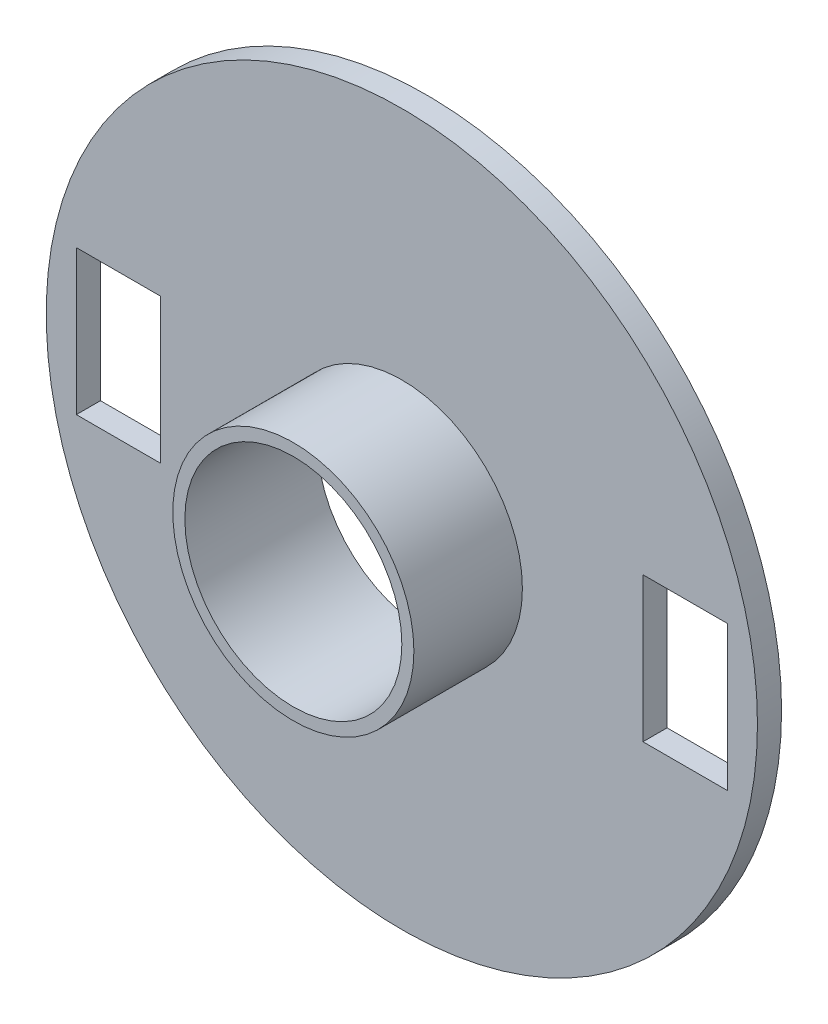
from build123d import *

# Parameters (mm, degrees)
SKETCH1_R           = 14.75
BOSS_EXTRUDE1_DEPTH = 1
SKETCH2_R           = 5
BOSS_EXTRUDE2_DEPTH = 4.5
SKETCH3_R           = 4.5
SKETCH3_W           = 3.5
SKETCH3_H           = 6
CUT_EXTRUDE1_DEPTH  = 22.572552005


with BuildPart() as part:
    # Sketch1 → Boss-Extrude1 (new body)
    with BuildSketch(Plane.XY):
        Circle(SKETCH1_R)
    extrude(amount=BOSS_EXTRUDE1_DEPTH)

    # Sketch2 → Boss-Extrude2 (add)
    with BuildSketch(Plane.XY.offset(1)):
        Circle(SKETCH2_R)
    extrude(amount=BOSS_EXTRUDE2_DEPTH)

    # Sketch3 → Cut-Extrude1 (cut, through all)
    with BuildSketch(Plane.XY.offset(5.5)):
        Circle(SKETCH3_R)
        with Locations((-11.75, 0)):
            Rectangle(SKETCH3_W, SKETCH3_H)
        with Locations((11.75, 0)):
            Rectangle(SKETCH3_W, SKETCH3_H)
    extrude(amount=-CUT_EXTRUDE1_DEPTH, mode=Mode.SUBTRACT)


solid = part.part
